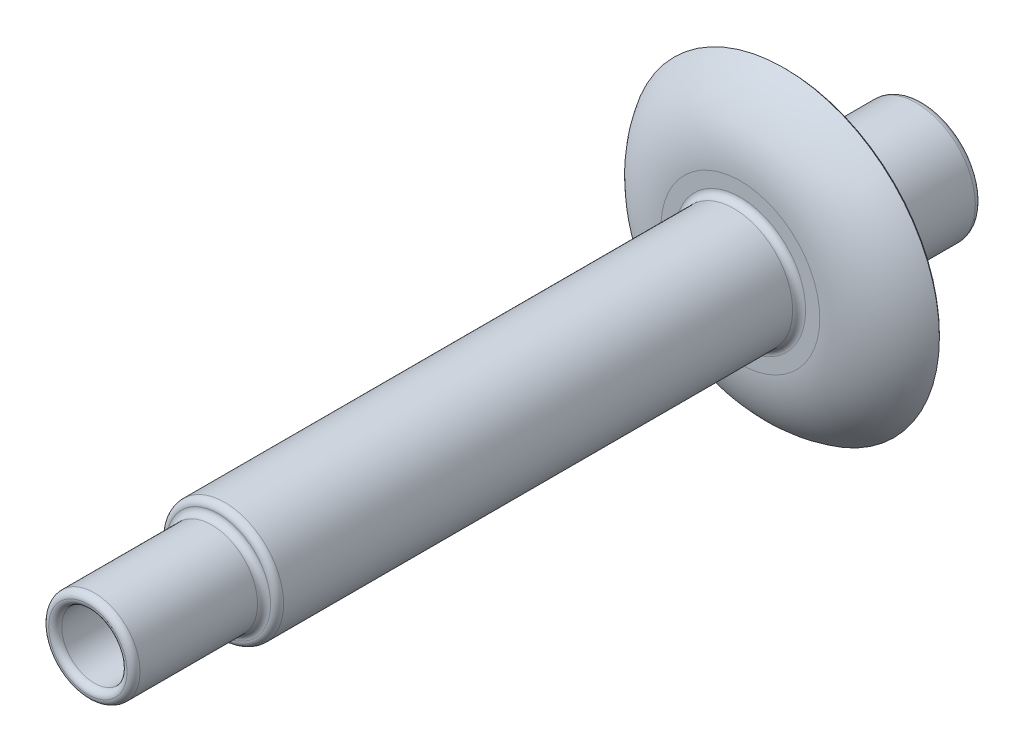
ISO-10303-21;
HEADER;
FILE_DESCRIPTION(('STEP AP214'),'2;1');
FILE_NAME('part.step','',(''),(''),'','','');
FILE_SCHEMA(('AUTOMOTIVE_DESIGN { 1 0 10303 214 1 1 1 1 }'));
ENDSEC;
DATA;
#1=APPLICATION_CONTEXT('core data for automotive mechanical design processes');
#2=APPLICATION_PROTOCOL_DEFINITION('international standard','automotive_design',2000,#1);
#3=PRODUCT_CONTEXT('',#1,'mechanical');
#4=PRODUCT('Part','Part','',(#3));
#5=PRODUCT_RELATED_PRODUCT_CATEGORY('part','',(#4));
#6=PRODUCT_DEFINITION_FORMATION('','',#4);
#7=PRODUCT_DEFINITION_CONTEXT('part definition',#1,'design');
#8=PRODUCT_DEFINITION('design','',#6,#7);
#9=PRODUCT_DEFINITION_SHAPE('','',#8);
#10=(LENGTH_UNIT() NAMED_UNIT(*) SI_UNIT(.MILLI.,.METRE.));
#11=(NAMED_UNIT(*) PLANE_ANGLE_UNIT() SI_UNIT($,.RADIAN.));
#12=(NAMED_UNIT(*) SI_UNIT($,.STERADIAN.) SOLID_ANGLE_UNIT());
#13=UNCERTAINTY_MEASURE_WITH_UNIT(LENGTH_MEASURE(1.E-05),#10,'distance_accuracy_value','');
#14=(GEOMETRIC_REPRESENTATION_CONTEXT(3) GLOBAL_UNCERTAINTY_ASSIGNED_CONTEXT((#13)) GLOBAL_UNIT_ASSIGNED_CONTEXT((#10,
#11,#12)) REPRESENTATION_CONTEXT('',''));
#15=CARTESIAN_POINT('',(0.,0.,0.));
#16=DIRECTION('',(0.,0.,1.));
#17=DIRECTION('',(1.,0.,0.));
#18=AXIS2_PLACEMENT_3D('',#15,#16,#17);
#19=CARTESIAN_POINT('',(0.,0.,32.));
#20=DIRECTION('',(0.,0.,1.));
#21=DIRECTION('',(1.,0.,0.));
#22=AXIS2_PLACEMENT_3D('',#19,#20,#21);
#23=CYLINDRICAL_SURFACE('',#22,2.5);
#24=CARTESIAN_POINT('',(0.,0.,31.5));
#25=DIRECTION('',(0.,0.,-1.));
#26=DIRECTION('',(-1.,0.,0.));
#27=AXIS2_PLACEMENT_3D('',#24,#25,#26);
#28=CIRCLE('',#27,2.5);
#29=CARTESIAN_POINT('',(-2.5,0.,31.5));
#30=VERTEX_POINT('',#29);
#31=EDGE_CURVE('E91',#30,#30,#28,.F.);
#32=ORIENTED_EDGE('',*,*,#31,.T.);
#33=EDGE_LOOP('',(#32));
#34=FACE_BOUND('',#33,.T.);
#35=CARTESIAN_POINT('',(0.,0.,-31.5));
#36=DIRECTION('',(0.,0.,1.));
#37=DIRECTION('',(1.,0.,0.));
#38=AXIS2_PLACEMENT_3D('',#35,#36,#37);
#39=CIRCLE('',#38,2.5);
#40=CARTESIAN_POINT('',(2.5,0.,-31.5));
#41=VERTEX_POINT('',#40);
#42=EDGE_CURVE('E101',#41,#41,#39,.F.);
#43=ORIENTED_EDGE('',*,*,#42,.T.);
#44=EDGE_LOOP('',(#43));
#45=FACE_BOUND('',#44,.T.);
#46=ADVANCED_FACE('F29',(#34,#45),#23,.F.);
#47=CARTESIAN_POINT('',(0.,2.5,-32.));
#48=DIRECTION('',(0.,0.,1.));
#49=DIRECTION('',(1.,0.,0.));
#50=AXIS2_PLACEMENT_3D('',#47,#48,#49);
#51=PLANE('',#50);
#52=CARTESIAN_POINT('',(0.,0.,-32.));
#53=DIRECTION('',(0.,0.,1.));
#54=DIRECTION('',(1.,0.,0.));
#55=AXIS2_PLACEMENT_3D('',#52,#53,#54);
#56=CIRCLE('',#55,4.);
#57=CARTESIAN_POINT('',(4.,0.,-32.));
#58=VERTEX_POINT('',#57);
#59=EDGE_CURVE('E107',#58,#58,#56,.F.);
#60=ORIENTED_EDGE('',*,*,#59,.T.);
#61=EDGE_LOOP('',(#60));
#62=FACE_BOUND('',#61,.T.);
#63=CARTESIAN_POINT('',(0.,0.,-32.));
#64=DIRECTION('',(0.,0.,1.));
#65=DIRECTION('',(1.,0.,0.));
#66=AXIS2_PLACEMENT_3D('',#63,#64,#65);
#67=CIRCLE('',#66,3.);
#68=CARTESIAN_POINT('',(3.,0.,-32.));
#69=VERTEX_POINT('',#68);
#70=EDGE_CURVE('E110',#69,#69,#67,.T.);
#71=ORIENTED_EDGE('',*,*,#70,.T.);
#72=EDGE_LOOP('',(#71));
#73=FACE_BOUND('',#72,.T.);
#74=ADVANCED_FACE('F154',(#62,#73),#51,.F.);
#75=CARTESIAN_POINT('',(0.,0.,32.));
#76=DIRECTION('',(0.,0.,1.));
#77=DIRECTION('',(1.,0.,0.));
#78=AXIS2_PLACEMENT_3D('',#75,#76,#77);
#79=CYLINDRICAL_SURFACE('',#78,4.5);
#80=CARTESIAN_POINT('',(0.,0.,-31.5));
#81=DIRECTION('',(0.,0.,1.));
#82=DIRECTION('',(1.,0.,0.));
#83=AXIS2_PLACEMENT_3D('',#80,#81,#82);
#84=CIRCLE('',#83,4.5);
#85=CARTESIAN_POINT('',(4.5,0.,-31.5));
#86=VERTEX_POINT('',#85);
#87=EDGE_CURVE('E113',#86,#86,#84,.T.);
#88=ORIENTED_EDGE('',*,*,#87,.T.);
#89=EDGE_LOOP('',(#88));
#90=FACE_BOUND('',#89,.T.);
#91=CARTESIAN_POINT('',(0.,0.,-22.));
#92=DIRECTION('',(0.,0.,1.));
#93=DIRECTION('',(1.,0.,0.));
#94=AXIS2_PLACEMENT_3D('',#91,#92,#93);
#95=CIRCLE('',#94,4.5);
#96=CARTESIAN_POINT('',(4.5,0.,-22.));
#97=VERTEX_POINT('',#96);
#98=EDGE_CURVE('E116',#97,#97,#95,.F.);
#99=ORIENTED_EDGE('',*,*,#98,.T.);
#100=EDGE_LOOP('',(#99));
#101=FACE_BOUND('',#100,.T.);
#102=ADVANCED_FACE('F150',(#90,#101),#79,.T.);
#103=CARTESIAN_POINT('',(0.,4.5,-21.5));
#104=DIRECTION('',(0.,0.,1.));
#105=DIRECTION('',(1.,0.,0.));
#106=AXIS2_PLACEMENT_3D('',#103,#104,#105);
#107=PLANE('',#106);
#108=CARTESIAN_POINT('',(0.,-7.5,-21.5));
#109=DIRECTION('',(0.,0.,1.));
#110=DIRECTION('',(1.,0.,0.));
#111=AXIS2_PLACEMENT_3D('',#108,#109,#110);
#112=CIRCLE('',#111,0.999999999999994);
#113=CARTESIAN_POINT('',(0.999999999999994,-7.5,-21.5));
#114=VERTEX_POINT('',#113);
#115=EDGE_CURVE('E70',#114,#114,#112,.T.);
#116=ORIENTED_EDGE('',*,*,#115,.T.);
#117=EDGE_LOOP('',(#116));
#118=FACE_BOUND('',#117,.T.);
#119=CARTESIAN_POINT('',(-7.5,0.,-21.5));
#120=DIRECTION('',(0.,0.,1.));
#121=DIRECTION('',(1.,0.,0.));
#122=AXIS2_PLACEMENT_3D('',#119,#120,#121);
#123=CIRCLE('',#122,0.999999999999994);
#124=CARTESIAN_POINT('',(-6.50000000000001,0.,-21.5));
#125=VERTEX_POINT('',#124);
#126=EDGE_CURVE('E73',#125,#125,#123,.T.);
#127=ORIENTED_EDGE('',*,*,#126,.T.);
#128=EDGE_LOOP('',(#127));
#129=FACE_BOUND('',#128,.T.);
#130=CARTESIAN_POINT('',(0.,7.5,-21.5));
#131=DIRECTION('',(0.,0.,1.));
#132=DIRECTION('',(1.,0.,0.));
#133=AXIS2_PLACEMENT_3D('',#130,#131,#132);
#134=CIRCLE('',#133,0.999999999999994);
#135=CARTESIAN_POINT('',(0.999999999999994,7.5,-21.5));
#136=VERTEX_POINT('',#135);
#137=EDGE_CURVE('E76',#136,#136,#134,.T.);
#138=ORIENTED_EDGE('',*,*,#137,.T.);
#139=EDGE_LOOP('',(#138));
#140=FACE_BOUND('',#139,.T.);
#141=CARTESIAN_POINT('',(7.5,0.,-21.5));
#142=DIRECTION('',(0.,0.,1.));
#143=DIRECTION('',(1.,0.,0.));
#144=AXIS2_PLACEMENT_3D('',#141,#142,#143);
#145=CIRCLE('',#144,0.999999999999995);
#146=CARTESIAN_POINT('',(8.49999999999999,0.,-21.5));
#147=VERTEX_POINT('',#146);
#148=EDGE_CURVE('E79',#147,#147,#145,.T.);
#149=ORIENTED_EDGE('',*,*,#148,.T.);
#150=EDGE_LOOP('',(#149));
#151=FACE_BOUND('',#150,.T.);
#152=CARTESIAN_POINT('',(0.,0.,-21.5));
#153=DIRECTION('',(0.,0.,1.));
#154=DIRECTION('',(1.,0.,0.));
#155=AXIS2_PLACEMENT_3D('',#152,#153,#154);
#156=CIRCLE('',#155,11.75);
#157=CARTESIAN_POINT('',(11.75,0.,-21.5));
#158=VERTEX_POINT('',#157);
#159=EDGE_CURVE('E82',#158,#158,#156,.F.);
#160=ORIENTED_EDGE('',*,*,#159,.T.);
#161=EDGE_LOOP('',(#160));
#162=FACE_BOUND('',#161,.T.);
#163=CARTESIAN_POINT('',(0.,0.,-21.5));
#164=DIRECTION('',(0.,0.,1.));
#165=DIRECTION('',(1.,0.,0.));
#166=AXIS2_PLACEMENT_3D('',#163,#164,#165);
#167=CIRCLE('',#166,5.);
#168=CARTESIAN_POINT('',(5.,0.,-21.5));
#169=VERTEX_POINT('',#168);
#170=EDGE_CURVE('E104',#169,#169,#167,.T.);
#171=ORIENTED_EDGE('',*,*,#170,.T.);
#172=EDGE_LOOP('',(#171));
#173=FACE_BOUND('',#172,.T.);
#174=ADVANCED_FACE('F141',(#118,#129,#140,#151,#162,#173),#107,.F.);
#175=CARTESIAN_POINT('',(0.,0.,-24.75));
#176=DIRECTION('',(0.,0.,1.));
#177=DIRECTION('',(1.,0.,0.));
#178=AXIS2_PLACEMENT_3D('',#175,#176,#177);
#179=DEGENERATE_TOROIDAL_SURFACE('',#178,6.08392021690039,6.75,.T.);
#180=CARTESIAN_POINT('',(0.,0.,-21.340476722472));
#181=DIRECTION('',(0.,0.,-1.));
#182=DIRECTION('',(-1.,0.,0.));
#183=AXIS2_PLACEMENT_3D('',#180,#181,#182);
#184=CIRCLE('',#183,11.9095232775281);
#185=CARTESIAN_POINT('',(-11.9095232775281,0.,-21.340476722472));
#186=VERTEX_POINT('',#185);
#187=EDGE_CURVE('E10',#186,#186,#184,.F.);
#188=ORIENTED_EDGE('',*,*,#187,.T.);
#189=EDGE_LOOP('',(#188));
#190=FACE_BOUND('',#189,.T.);
#191=CARTESIAN_POINT('',(0.,0.,-18.));
#192=DIRECTION('',(0.,0.,1.));
#193=DIRECTION('',(1.,0.,0.));
#194=AXIS2_PLACEMENT_3D('',#191,#192,#193);
#195=CIRCLE('',#194,6.08392021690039);
#196=CARTESIAN_POINT('',(6.08392021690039,0.,-18.));
#197=VERTEX_POINT('',#196);
#198=EDGE_CURVE('E98',#197,#197,#195,.T.);
#199=ORIENTED_EDGE('',*,*,#198,.F.);
#200=EDGE_LOOP('',(#199));
#201=FACE_BOUND('',#200,.T.);
#202=ADVANCED_FACE('F139',(#190,#201),#179,.T.);
#203=CARTESIAN_POINT('',(0.,6.08392021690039,-18.));
#204=DIRECTION('',(0.,0.,-1.));
#205=DIRECTION('',(-1.,0.,0.));
#206=AXIS2_PLACEMENT_3D('',#203,#204,#205);
#207=PLANE('',#206);
#208=CARTESIAN_POINT('',(0.,0.,-18.));
#209=DIRECTION('',(0.,0.,-1.));
#210=DIRECTION('',(-1.,0.,0.));
#211=AXIS2_PLACEMENT_3D('',#208,#209,#210);
#212=CIRCLE('',#211,5.);
#213=CARTESIAN_POINT('',(-5.,0.,-18.));
#214=VERTEX_POINT('',#213);
#215=EDGE_CURVE('E119',#214,#214,#212,.T.);
#216=ORIENTED_EDGE('',*,*,#215,.T.);
#217=EDGE_LOOP('',(#216));
#218=FACE_BOUND('',#217,.T.);
#219=ORIENTED_EDGE('',*,*,#198,.T.);
#220=EDGE_LOOP('',(#219));
#221=FACE_BOUND('',#220,.T.);
#222=ADVANCED_FACE('F137',(#218,#221),#207,.F.);
#223=CARTESIAN_POINT('',(0.,0.,32.));
#224=DIRECTION('',(0.,0.,1.));
#225=DIRECTION('',(1.,0.,0.));
#226=AXIS2_PLACEMENT_3D('',#223,#224,#225);
#227=CYLINDRICAL_SURFACE('',#226,4.5);
#228=CARTESIAN_POINT('',(0.,0.,-17.5));
#229=DIRECTION('',(0.,0.,-1.));
#230=DIRECTION('',(-1.,0.,0.));
#231=AXIS2_PLACEMENT_3D('',#228,#229,#230);
#232=CIRCLE('',#231,4.5);
#233=CARTESIAN_POINT('',(-4.5,0.,-17.5));
#234=VERTEX_POINT('',#233);
#235=EDGE_CURVE('E122',#234,#234,#232,.F.);
#236=ORIENTED_EDGE('',*,*,#235,.T.);
#237=EDGE_LOOP('',(#236));
#238=FACE_BOUND('',#237,.T.);
#239=CARTESIAN_POINT('',(0.,0.,21.5));
#240=DIRECTION('',(0.,0.,-1.));
#241=DIRECTION('',(-1.,0.,0.));
#242=AXIS2_PLACEMENT_3D('',#239,#240,#241);
#243=CIRCLE('',#242,4.5);
#244=CARTESIAN_POINT('',(-4.5,0.,21.5));
#245=VERTEX_POINT('',#244);
#246=EDGE_CURVE('E125',#245,#245,#243,.T.);
#247=ORIENTED_EDGE('',*,*,#246,.T.);
#248=EDGE_LOOP('',(#247));
#249=FACE_BOUND('',#248,.T.);
#250=ADVANCED_FACE('F147',(#238,#249),#227,.T.);
#251=CARTESIAN_POINT('',(0.,0.,32.));
#252=DIRECTION('',(0.,0.,1.));
#253=DIRECTION('',(1.,0.,0.));
#254=AXIS2_PLACEMENT_3D('',#251,#252,#253);
#255=CYLINDRICAL_SURFACE('',#254,3.5);
#256=CARTESIAN_POINT('',(0.,0.,22.5));
#257=DIRECTION('',(0.,0.,-1.));
#258=DIRECTION('',(-1.,0.,0.));
#259=AXIS2_PLACEMENT_3D('',#256,#257,#258);
#260=CIRCLE('',#259,3.5);
#261=CARTESIAN_POINT('',(-3.5,0.,22.5));
#262=VERTEX_POINT('',#261);
#263=EDGE_CURVE('E128',#262,#262,#260,.F.);
#264=ORIENTED_EDGE('',*,*,#263,.T.);
#265=EDGE_LOOP('',(#264));
#266=FACE_BOUND('',#265,.T.);
#267=CARTESIAN_POINT('',(0.,0.,31.5));
#268=DIRECTION('',(0.,0.,-1.));
#269=DIRECTION('',(-1.,0.,0.));
#270=AXIS2_PLACEMENT_3D('',#267,#268,#269);
#271=CIRCLE('',#270,3.5);
#272=CARTESIAN_POINT('',(-3.5,0.,31.5));
#273=VERTEX_POINT('',#272);
#274=EDGE_CURVE('E131',#273,#273,#271,.T.);
#275=ORIENTED_EDGE('',*,*,#274,.T.);
#276=EDGE_LOOP('',(#275));
#277=FACE_BOUND('',#276,.T.);
#278=ADVANCED_FACE('F262',(#266,#277),#255,.T.);
#279=CARTESIAN_POINT('',(-7.5,0.,-19.));
#280=DIRECTION('',(0.,0.,-1.));
#281=DIRECTION('',(-1.,0.,0.));
#282=AXIS2_PLACEMENT_3D('',#279,#280,#281);
#283=CYLINDRICAL_SURFACE('',#282,0.75);
#284=CARTESIAN_POINT('',(-7.5,0.,-21.25));
#285=DIRECTION('',(0.,0.,1.));
#286=DIRECTION('',(1.,0.,0.));
#287=AXIS2_PLACEMENT_3D('',#284,#285,#286);
#288=CIRCLE('',#287,0.75);
#289=CARTESIAN_POINT('',(-6.75,0.,-21.25));
#290=VERTEX_POINT('',#289);
#291=EDGE_CURVE('E61',#290,#290,#288,.F.);
#292=ORIENTED_EDGE('',*,*,#291,.T.);
#293=EDGE_LOOP('',(#292));
#294=FACE_BOUND('',#293,.T.);
#295=CARTESIAN_POINT('',(-7.5,0.,-19.25));
#296=DIRECTION('',(0.,0.,-1.));
#297=DIRECTION('',(-1.,0.,0.));
#298=AXIS2_PLACEMENT_3D('',#295,#296,#297);
#299=CIRCLE('',#298,0.75);
#300=CARTESIAN_POINT('',(-8.25,0.,-19.25));
#301=VERTEX_POINT('',#300);
#302=EDGE_CURVE('E64',#301,#301,#299,.F.);
#303=ORIENTED_EDGE('',*,*,#302,.T.);
#304=EDGE_LOOP('',(#303));
#305=FACE_BOUND('',#304,.T.);
#306=ADVANCED_FACE('F258',(#294,#305),#283,.F.);
#307=CARTESIAN_POINT('',(-7.5,0.,-19.));
#308=DIRECTION('',(0.,0.,-1.));
#309=DIRECTION('',(-1.,0.,0.));
#310=AXIS2_PLACEMENT_3D('',#307,#308,#309);
#311=PLANE('',#310);
#312=CARTESIAN_POINT('',(-7.5,0.,-19.));
#313=DIRECTION('',(0.,0.,-1.));
#314=DIRECTION('',(-1.,0.,0.));
#315=AXIS2_PLACEMENT_3D('',#312,#313,#314);
#316=CIRCLE('',#315,0.500000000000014);
#317=CARTESIAN_POINT('',(-8.00000000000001,0.,-19.));
#318=VERTEX_POINT('',#317);
#319=EDGE_CURVE('E58',#318,#318,#316,.T.);
#320=ORIENTED_EDGE('',*,*,#319,.T.);
#321=EDGE_LOOP('',(#320));
#322=FACE_BOUND('',#321,.T.);
#323=ADVANCED_FACE('F254',(#322),#311,.T.);
#324=CARTESIAN_POINT('',(0.,-7.5,-19.));
#325=DIRECTION('',(0.,0.,-1.));
#326=DIRECTION('',(-1.,0.,0.));
#327=AXIS2_PLACEMENT_3D('',#324,#325,#326);
#328=CYLINDRICAL_SURFACE('',#327,0.75);
#329=CARTESIAN_POINT('',(0.,-7.5,-21.25));
#330=DIRECTION('',(0.,0.,1.));
#331=DIRECTION('',(1.,0.,0.));
#332=AXIS2_PLACEMENT_3D('',#329,#330,#331);
#333=CIRCLE('',#332,0.75);
#334=CARTESIAN_POINT('',(0.75,-7.5,-21.25));
#335=VERTEX_POINT('',#334);
#336=EDGE_CURVE('E85',#335,#335,#333,.F.);
#337=ORIENTED_EDGE('',*,*,#336,.T.);
#338=EDGE_LOOP('',(#337));
#339=FACE_BOUND('',#338,.T.);
#340=CARTESIAN_POINT('',(0.,-7.5,-19.25));
#341=DIRECTION('',(0.,0.,-1.));
#342=DIRECTION('',(-1.,0.,0.));
#343=AXIS2_PLACEMENT_3D('',#340,#341,#342);
#344=CIRCLE('',#343,0.75);
#345=CARTESIAN_POINT('',(-0.75,-7.5,-19.25));
#346=VERTEX_POINT('',#345);
#347=EDGE_CURVE('E88',#346,#346,#344,.F.);
#348=ORIENTED_EDGE('',*,*,#347,.T.);
#349=EDGE_LOOP('',(#348));
#350=FACE_BOUND('',#349,.T.);
#351=ADVANCED_FACE('F247',(#339,#350),#328,.F.);
#352=CARTESIAN_POINT('',(0.,-7.5,-19.));
#353=DIRECTION('',(0.,0.,-1.));
#354=DIRECTION('',(-1.,0.,0.));
#355=AXIS2_PLACEMENT_3D('',#352,#353,#354);
#356=PLANE('',#355);
#357=CARTESIAN_POINT('',(0.,-7.5,-19.));
#358=DIRECTION('',(0.,0.,-1.));
#359=DIRECTION('',(-1.,0.,0.));
#360=AXIS2_PLACEMENT_3D('',#357,#358,#359);
#361=CIRCLE('',#360,0.500000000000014);
#362=CARTESIAN_POINT('',(-0.500000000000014,-7.5,-19.));
#363=VERTEX_POINT('',#362);
#364=EDGE_CURVE('E67',#363,#363,#361,.T.);
#365=ORIENTED_EDGE('',*,*,#364,.T.);
#366=EDGE_LOOP('',(#365));
#367=FACE_BOUND('',#366,.T.);
#368=ADVANCED_FACE('F238',(#367),#356,.T.);
#369=CARTESIAN_POINT('',(7.5,0.,-19.));
#370=DIRECTION('',(0.,0.,-1.));
#371=DIRECTION('',(-1.,0.,0.));
#372=AXIS2_PLACEMENT_3D('',#369,#370,#371);
#373=CYLINDRICAL_SURFACE('',#372,0.749999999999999);
#374=CARTESIAN_POINT('',(7.5,0.,-21.25));
#375=DIRECTION('',(0.,0.,1.));
#376=DIRECTION('',(1.,0.,0.));
#377=AXIS2_PLACEMENT_3D('',#374,#375,#376);
#378=CIRCLE('',#377,0.749999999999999);
#379=CARTESIAN_POINT('',(8.25,0.,-21.25));
#380=VERTEX_POINT('',#379);
#381=EDGE_CURVE('E40',#380,#380,#378,.F.);
#382=ORIENTED_EDGE('',*,*,#381,.T.);
#383=EDGE_LOOP('',(#382));
#384=FACE_BOUND('',#383,.T.);
#385=CARTESIAN_POINT('',(7.5,0.,-19.25));
#386=DIRECTION('',(0.,0.,-1.));
#387=DIRECTION('',(-1.,0.,0.));
#388=AXIS2_PLACEMENT_3D('',#385,#386,#387);
#389=CIRCLE('',#388,0.749999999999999);
#390=CARTESIAN_POINT('',(6.75,0.,-19.25));
#391=VERTEX_POINT('',#390);
#392=EDGE_CURVE('E44',#391,#391,#389,.F.);
#393=ORIENTED_EDGE('',*,*,#392,.T.);
#394=EDGE_LOOP('',(#393));
#395=FACE_BOUND('',#394,.T.);
#396=ADVANCED_FACE('F235',(#384,#395),#373,.F.);
#397=CARTESIAN_POINT('',(7.5,0.,-19.));
#398=DIRECTION('',(0.,0.,-1.));
#399=DIRECTION('',(-1.,0.,0.));
#400=AXIS2_PLACEMENT_3D('',#397,#398,#399);
#401=PLANE('',#400);
#402=CARTESIAN_POINT('',(7.5,0.,-19.));
#403=DIRECTION('',(0.,0.,-1.));
#404=DIRECTION('',(-1.,0.,0.));
#405=AXIS2_PLACEMENT_3D('',#402,#403,#404);
#406=CIRCLE('',#405,0.499999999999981);
#407=CARTESIAN_POINT('',(7.00000000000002,0.,-19.));
#408=VERTEX_POINT('',#407);
#409=EDGE_CURVE('E36',#408,#408,#406,.T.);
#410=ORIENTED_EDGE('',*,*,#409,.T.);
#411=EDGE_LOOP('',(#410));
#412=FACE_BOUND('',#411,.T.);
#413=ADVANCED_FACE('F237',(#412),#401,.T.);
#414=CARTESIAN_POINT('',(0.,7.5,-19.));
#415=DIRECTION('',(0.,0.,-1.));
#416=DIRECTION('',(-1.,0.,0.));
#417=AXIS2_PLACEMENT_3D('',#414,#415,#416);
#418=CYLINDRICAL_SURFACE('',#417,0.75);
#419=CARTESIAN_POINT('',(0.,7.5,-21.25));
#420=DIRECTION('',(0.,0.,1.));
#421=DIRECTION('',(1.,0.,0.));
#422=AXIS2_PLACEMENT_3D('',#419,#420,#421);
#423=CIRCLE('',#422,0.75);
#424=CARTESIAN_POINT('',(0.75,7.5,-21.25));
#425=VERTEX_POINT('',#424);
#426=EDGE_CURVE('E52',#425,#425,#423,.F.);
#427=ORIENTED_EDGE('',*,*,#426,.T.);
#428=EDGE_LOOP('',(#427));
#429=FACE_BOUND('',#428,.T.);
#430=CARTESIAN_POINT('',(0.,7.5,-19.25));
#431=DIRECTION('',(0.,0.,-1.));
#432=DIRECTION('',(-1.,0.,0.));
#433=AXIS2_PLACEMENT_3D('',#430,#431,#432);
#434=CIRCLE('',#433,0.75);
#435=CARTESIAN_POINT('',(-0.75,7.5,-19.25));
#436=VERTEX_POINT('',#435);
#437=EDGE_CURVE('E55',#436,#436,#434,.F.);
#438=ORIENTED_EDGE('',*,*,#437,.T.);
#439=EDGE_LOOP('',(#438));
#440=FACE_BOUND('',#439,.T.);
#441=ADVANCED_FACE('F245',(#429,#440),#418,.F.);
#442=CARTESIAN_POINT('',(0.,7.5,-19.));
#443=DIRECTION('',(0.,0.,-1.));
#444=DIRECTION('',(-1.,0.,0.));
#445=AXIS2_PLACEMENT_3D('',#442,#443,#444);
#446=PLANE('',#445);
#447=CARTESIAN_POINT('',(0.,7.5,-19.));
#448=DIRECTION('',(0.,0.,-1.));
#449=DIRECTION('',(-1.,0.,0.));
#450=AXIS2_PLACEMENT_3D('',#447,#448,#449);
#451=CIRCLE('',#450,0.500000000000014);
#452=CARTESIAN_POINT('',(-0.500000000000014,7.5,-19.));
#453=VERTEX_POINT('',#452);
#454=EDGE_CURVE('E49',#453,#453,#451,.T.);
#455=ORIENTED_EDGE('',*,*,#454,.T.);
#456=EDGE_LOOP('',(#455));
#457=FACE_BOUND('',#456,.T.);
#458=ADVANCED_FACE('F173',(#457),#446,.T.);
#459=CARTESIAN_POINT('',(0.,0.,21.5));
#460=DIRECTION('',(0.,0.,-1.));
#461=DIRECTION('',(-1.,0.,0.));
#462=AXIS2_PLACEMENT_3D('',#459,#460,#461);
#463=TOROIDAL_SURFACE('',#462,4.,0.5);
#464=ORIENTED_EDGE('',*,*,#246,.F.);
#465=EDGE_LOOP('',(#464));
#466=FACE_BOUND('',#465,.T.);
#467=CARTESIAN_POINT('',(0.,0.,22.));
#468=DIRECTION('',(0.,0.,-1.));
#469=DIRECTION('',(-1.,0.,0.));
#470=AXIS2_PLACEMENT_3D('',#467,#468,#469);
#471=CIRCLE('',#470,4.);
#472=CARTESIAN_POINT('',(-4.,0.,22.));
#473=VERTEX_POINT('',#472);
#474=EDGE_CURVE('E95',#473,#473,#471,.F.);
#475=ORIENTED_EDGE('',*,*,#474,.F.);
#476=EDGE_LOOP('',(#475));
#477=FACE_BOUND('',#476,.T.);
#478=ADVANCED_FACE('F169',(#466,#477),#463,.T.);
#479=CARTESIAN_POINT('',(0.,0.,22.5));
#480=DIRECTION('',(0.,0.,-1.));
#481=DIRECTION('',(-1.,0.,0.));
#482=AXIS2_PLACEMENT_3D('',#479,#480,#481);
#483=TOROIDAL_SURFACE('',#482,4.,0.5);
#484=ORIENTED_EDGE('',*,*,#474,.T.);
#485=EDGE_LOOP('',(#484));
#486=FACE_BOUND('',#485,.T.);
#487=ORIENTED_EDGE('',*,*,#263,.F.);
#488=EDGE_LOOP('',(#487));
#489=FACE_BOUND('',#488,.T.);
#490=ADVANCED_FACE('F165',(#486,#489),#483,.F.);
#491=CARTESIAN_POINT('',(0.,0.,31.5));
#492=DIRECTION('',(0.,0.,-1.));
#493=DIRECTION('',(-1.,0.,0.));
#494=AXIS2_PLACEMENT_3D('',#491,#492,#493);
#495=TOROIDAL_SURFACE('',#494,3.,0.5);
#496=ORIENTED_EDGE('',*,*,#31,.F.);
#497=EDGE_LOOP('',(#496));
#498=FACE_BOUND('',#497,.T.);
#499=CARTESIAN_POINT('',(0.,0.,32.));
#500=DIRECTION('',(0.,0.,-1.));
#501=DIRECTION('',(-1.,0.,0.));
#502=AXIS2_PLACEMENT_3D('',#499,#500,#501);
#503=CIRCLE('',#502,3.);
#504=CARTESIAN_POINT('',(-3.,0.,32.));
#505=VERTEX_POINT('',#504);
#506=EDGE_CURVE('E92',#505,#505,#503,.T.);
#507=ORIENTED_EDGE('',*,*,#506,.F.);
#508=EDGE_LOOP('',(#507));
#509=FACE_BOUND('',#508,.T.);
#510=ADVANCED_FACE('F168',(#498,#509),#495,.T.);
#511=CARTESIAN_POINT('',(0.,0.,31.5));
#512=DIRECTION('',(0.,0.,-1.));
#513=DIRECTION('',(-1.,0.,0.));
#514=AXIS2_PLACEMENT_3D('',#511,#512,#513);
#515=TOROIDAL_SURFACE('',#514,3.,0.5);
#516=ORIENTED_EDGE('',*,*,#274,.F.);
#517=EDGE_LOOP('',(#516));
#518=FACE_BOUND('',#517,.T.);
#519=ORIENTED_EDGE('',*,*,#506,.T.);
#520=EDGE_LOOP('',(#519));
#521=FACE_BOUND('',#520,.T.);
#522=ADVANCED_FACE('F175',(#518,#521),#515,.T.);
#523=CARTESIAN_POINT('',(0.,0.,-17.5));
#524=DIRECTION('',(0.,0.,-1.));
#525=DIRECTION('',(-1.,0.,0.));
#526=AXIS2_PLACEMENT_3D('',#523,#524,#525);
#527=TOROIDAL_SURFACE('',#526,5.,0.5);
#528=ORIENTED_EDGE('',*,*,#215,.F.);
#529=EDGE_LOOP('',(#528));
#530=FACE_BOUND('',#529,.T.);
#531=ORIENTED_EDGE('',*,*,#235,.F.);
#532=EDGE_LOOP('',(#531));
#533=FACE_BOUND('',#532,.T.);
#534=ADVANCED_FACE('F178',(#530,#533),#527,.F.);
#535=CARTESIAN_POINT('',(0.,0.,-31.5));
#536=DIRECTION('',(0.,0.,1.));
#537=DIRECTION('',(1.,0.,0.));
#538=AXIS2_PLACEMENT_3D('',#535,#536,#537);
#539=TOROIDAL_SURFACE('',#538,4.,0.5);
#540=ORIENTED_EDGE('',*,*,#59,.F.);
#541=EDGE_LOOP('',(#540));
#542=FACE_BOUND('',#541,.T.);
#543=ORIENTED_EDGE('',*,*,#87,.F.);
#544=EDGE_LOOP('',(#543));
#545=FACE_BOUND('',#544,.T.);
#546=ADVANCED_FACE('F185',(#542,#545),#539,.T.);
#547=CARTESIAN_POINT('',(0.,0.,-22.));
#548=DIRECTION('',(0.,0.,1.));
#549=DIRECTION('',(1.,0.,0.));
#550=AXIS2_PLACEMENT_3D('',#547,#548,#549);
#551=TOROIDAL_SURFACE('',#550,5.,0.5);
#552=ORIENTED_EDGE('',*,*,#98,.F.);
#553=EDGE_LOOP('',(#552));
#554=FACE_BOUND('',#553,.T.);
#555=ORIENTED_EDGE('',*,*,#170,.F.);
#556=EDGE_LOOP('',(#555));
#557=FACE_BOUND('',#556,.T.);
#558=ADVANCED_FACE('F189',(#554,#557),#551,.F.);
#559=CARTESIAN_POINT('',(0.,0.,-31.5));
#560=DIRECTION('',(0.,0.,1.));
#561=DIRECTION('',(1.,0.,0.));
#562=AXIS2_PLACEMENT_3D('',#559,#560,#561);
#563=TOROIDAL_SURFACE('',#562,3.,0.5);
#564=ORIENTED_EDGE('',*,*,#42,.F.);
#565=EDGE_LOOP('',(#564));
#566=FACE_BOUND('',#565,.T.);
#567=ORIENTED_EDGE('',*,*,#70,.F.);
#568=EDGE_LOOP('',(#567));
#569=FACE_BOUND('',#568,.T.);
#570=ADVANCED_FACE('F193',(#566,#569),#563,.T.);
#571=CARTESIAN_POINT('',(0.,-7.5,-21.25));
#572=DIRECTION('',(0.,0.,-1.));
#573=DIRECTION('',(-1.,0.,0.));
#574=AXIS2_PLACEMENT_3D('',#571,#572,#573);
#575=CONICAL_SURFACE('',#574,0.75,0.785398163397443);
#576=ORIENTED_EDGE('',*,*,#115,.F.);
#577=EDGE_LOOP('',(#576));
#578=FACE_BOUND('',#577,.T.);
#579=ORIENTED_EDGE('',*,*,#336,.F.);
#580=EDGE_LOOP('',(#579));
#581=FACE_BOUND('',#580,.T.);
#582=ADVANCED_FACE('F197',(#578,#581),#575,.F.);
#583=CARTESIAN_POINT('',(0.,-7.5,-19.));
#584=DIRECTION('',(0.,0.,-1.));
#585=DIRECTION('',(-1.,0.,0.));
#586=AXIS2_PLACEMENT_3D('',#583,#584,#585);
#587=CONICAL_SURFACE('',#586,0.500000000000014,0.785398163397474);
#588=ORIENTED_EDGE('',*,*,#347,.F.);
#589=EDGE_LOOP('',(#588));
#590=FACE_BOUND('',#589,.T.);
#591=ORIENTED_EDGE('',*,*,#364,.F.);
#592=EDGE_LOOP('',(#591));
#593=FACE_BOUND('',#592,.T.);
#594=ADVANCED_FACE('F201',(#590,#593),#587,.F.);
#595=CARTESIAN_POINT('',(-7.5,0.,-21.25));
#596=DIRECTION('',(0.,0.,-1.));
#597=DIRECTION('',(-1.,0.,0.));
#598=AXIS2_PLACEMENT_3D('',#595,#596,#597);
#599=CONICAL_SURFACE('',#598,0.75,0.785398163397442);
#600=ORIENTED_EDGE('',*,*,#126,.F.);
#601=EDGE_LOOP('',(#600));
#602=FACE_BOUND('',#601,.T.);
#603=ORIENTED_EDGE('',*,*,#291,.F.);
#604=EDGE_LOOP('',(#603));
#605=FACE_BOUND('',#604,.T.);
#606=ADVANCED_FACE('F205',(#602,#605),#599,.F.);
#607=CARTESIAN_POINT('',(-7.5,0.,-19.));
#608=DIRECTION('',(0.,0.,-1.));
#609=DIRECTION('',(-1.,0.,0.));
#610=AXIS2_PLACEMENT_3D('',#607,#608,#609);
#611=CONICAL_SURFACE('',#610,0.500000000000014,0.785398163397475);
#612=ORIENTED_EDGE('',*,*,#302,.F.);
#613=EDGE_LOOP('',(#612));
#614=FACE_BOUND('',#613,.T.);
#615=ORIENTED_EDGE('',*,*,#319,.F.);
#616=EDGE_LOOP('',(#615));
#617=FACE_BOUND('',#616,.T.);
#618=ADVANCED_FACE('F209',(#614,#617),#611,.F.);
#619=CARTESIAN_POINT('',(0.,7.5,-21.25));
#620=DIRECTION('',(0.,0.,-1.));
#621=DIRECTION('',(-1.,0.,0.));
#622=AXIS2_PLACEMENT_3D('',#619,#620,#621);
#623=CONICAL_SURFACE('',#622,0.75,0.785398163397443);
#624=ORIENTED_EDGE('',*,*,#137,.F.);
#625=EDGE_LOOP('',(#624));
#626=FACE_BOUND('',#625,.T.);
#627=ORIENTED_EDGE('',*,*,#426,.F.);
#628=EDGE_LOOP('',(#627));
#629=FACE_BOUND('',#628,.T.);
#630=ADVANCED_FACE('F213',(#626,#629),#623,.F.);
#631=CARTESIAN_POINT('',(0.,7.5,-19.));
#632=DIRECTION('',(0.,0.,-1.));
#633=DIRECTION('',(-1.,0.,0.));
#634=AXIS2_PLACEMENT_3D('',#631,#632,#633);
#635=CONICAL_SURFACE('',#634,0.500000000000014,0.785398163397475);
#636=ORIENTED_EDGE('',*,*,#437,.F.);
#637=EDGE_LOOP('',(#636));
#638=FACE_BOUND('',#637,.T.);
#639=ORIENTED_EDGE('',*,*,#454,.F.);
#640=EDGE_LOOP('',(#639));
#641=FACE_BOUND('',#640,.T.);
#642=ADVANCED_FACE('F217',(#638,#641),#635,.F.);
#643=CARTESIAN_POINT('',(7.5,0.,-21.25));
#644=DIRECTION('',(0.,0.,-1.));
#645=DIRECTION('',(-1.,0.,0.));
#646=AXIS2_PLACEMENT_3D('',#643,#644,#645);
#647=CONICAL_SURFACE('',#646,0.749999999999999,0.785398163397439);
#648=ORIENTED_EDGE('',*,*,#148,.F.);
#649=EDGE_LOOP('',(#648));
#650=FACE_BOUND('',#649,.T.);
#651=ORIENTED_EDGE('',*,*,#381,.F.);
#652=EDGE_LOOP('',(#651));
#653=FACE_BOUND('',#652,.T.);
#654=ADVANCED_FACE('F221',(#650,#653),#647,.F.);
#655=CARTESIAN_POINT('',(7.5,0.,-19.));
#656=DIRECTION('',(0.,0.,-1.));
#657=DIRECTION('',(-1.,0.,0.));
#658=AXIS2_PLACEMENT_3D('',#655,#656,#657);
#659=CONICAL_SURFACE('',#658,0.499999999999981,0.785398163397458);
#660=ORIENTED_EDGE('',*,*,#392,.F.);
#661=EDGE_LOOP('',(#660));
#662=FACE_BOUND('',#661,.T.);
#663=ORIENTED_EDGE('',*,*,#409,.F.);
#664=EDGE_LOOP('',(#663));
#665=FACE_BOUND('',#664,.T.);
#666=ADVANCED_FACE('F224',(#662,#665),#659,.F.);
#667=CARTESIAN_POINT('',(0.,0.,-21.340476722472));
#668=DIRECTION('',(0.,0.,1.));
#669=DIRECTION('',(1.,0.,0.));
#670=AXIS2_PLACEMENT_3D('',#667,#668,#669);
#671=CONICAL_SURFACE('',#670,11.9095232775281,0.785398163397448);
#672=ORIENTED_EDGE('',*,*,#159,.F.);
#673=EDGE_LOOP('',(#672));
#674=FACE_BOUND('',#673,.T.);
#675=ORIENTED_EDGE('',*,*,#187,.F.);
#676=EDGE_LOOP('',(#675));
#677=FACE_BOUND('',#676,.T.);
#678=ADVANCED_FACE('F31',(#674,#677),#671,.T.);
#679=CLOSED_SHELL('',(#46,#74,#102,#174,#202,#222,#250,#278,#306,#323,#351,#368,#396,#413,#441,
#458,#478,#490,#510,#522,#534,#546,#558,#570,#582,#594,#606,#618,#630,#642,#654,#666,#678));
#680=MANIFOLD_SOLID_BREP('B2',#679);
#681=ADVANCED_BREP_SHAPE_REPRESENTATION('',(#18,#680),#14);
#682=SHAPE_DEFINITION_REPRESENTATION(#9,#681);
ENDSEC;
END-ISO-10303-21;
